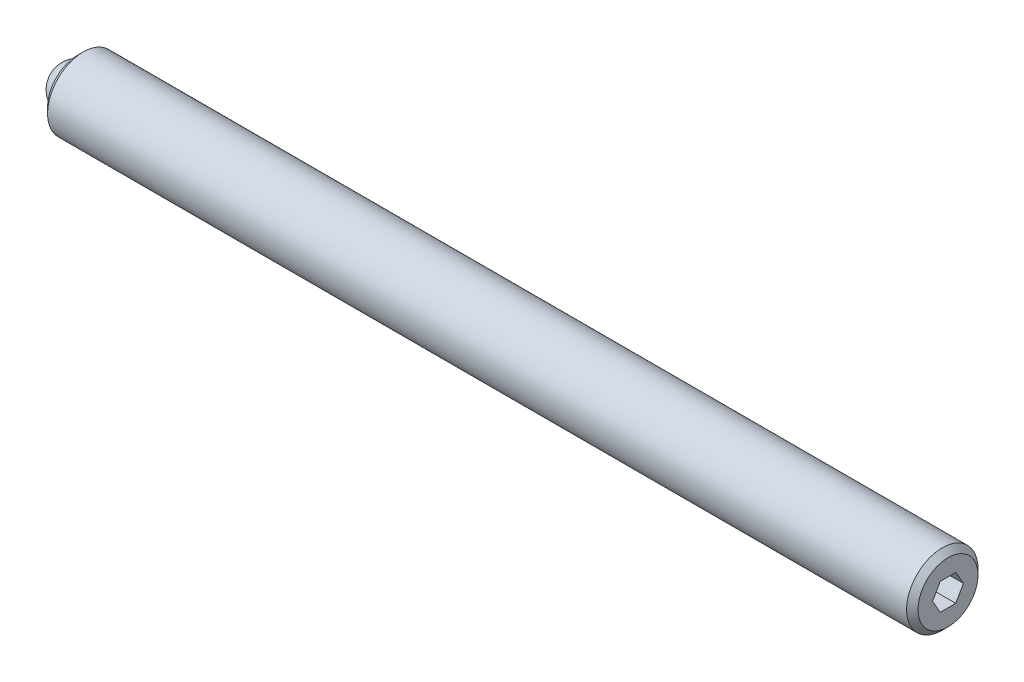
from build123d import *

# Parameters (mm, degrees)
SKETCH2_R           = 3.175
BOSS_EXTRUDE1_DEPTH = 77.390625
CHAMFER1_SIZE       = 0.508
CHAMFER2_SIZE       = 0.508
CUT_EXTRUDE2_DEPTH  = 2.286
SKETCH3_R           = 1.9812
CUT_EXTRUDE3_DEPTH  = 1.984375


with BuildPart() as part:
    # Sketch2 → Boss-Extrude1 (new body)
    with BuildSketch(Plane(origin=(0, 0, 0), x_dir=(0, 0, -1), z_dir=(1, 0, 0))):
        Circle(SKETCH2_R)
    extrude(amount=BOSS_EXTRUDE1_DEPTH)

    # Chamfer1
    chamfer1_edges = [part.edges().sort_by_distance(p)[0] for p in [
        (0, 0, 3.175),
    ]]
    chamfer(chamfer1_edges, length=CHAMFER1_SIZE)

    # Chamfer2
    chamfer2_edges = [part.edges().sort_by_distance(p)[0] for p in [
        (77.390625, 0, 3.175),
    ]]
    chamfer(chamfer2_edges, length=CHAMFER2_SIZE)

    # Sketch4 → Cut-Extrude2 (cut)
    with BuildSketch(Plane(origin=(77.390625, 0, 0), x_dir=(0, 0, -1), z_dir=(1, 0, 0))):
        Polygon((1.374815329, 0), (0.687407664, 1.190625), (-0.687407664, 1.190625), (-1.374815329, 0), (-0.687407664, -1.190625), (0.687407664, -1.190625), align=None)
    extrude(amount=-CUT_EXTRUDE2_DEPTH, mode=Mode.SUBTRACT)

    # Sketch3 → Cut-Extrude3 (cut)
    with BuildSketch(Plane.ZY):
        Circle(SKETCH3_R)
    extrude(amount=-CUT_EXTRUDE3_DEPTH, mode=Mode.SUBTRACT)


with BuildPart() as body_2:
    # Sketch5 → Revolve1 (revolve)
    with BuildSketch(Plane.ZY):
        with BuildLine():
            Line((0, 0), (0, -1.984375))
            ThreePointArc((0, -1.984375), (-1.984375, 0), (0, 1.984375))
            Line((0, 1.984375), (0, 0))
        make_face()
    revolve(axis=Axis((0, 0, 0), (0, 1, 0)))


solid = Compound([part.part, body_2.part])
